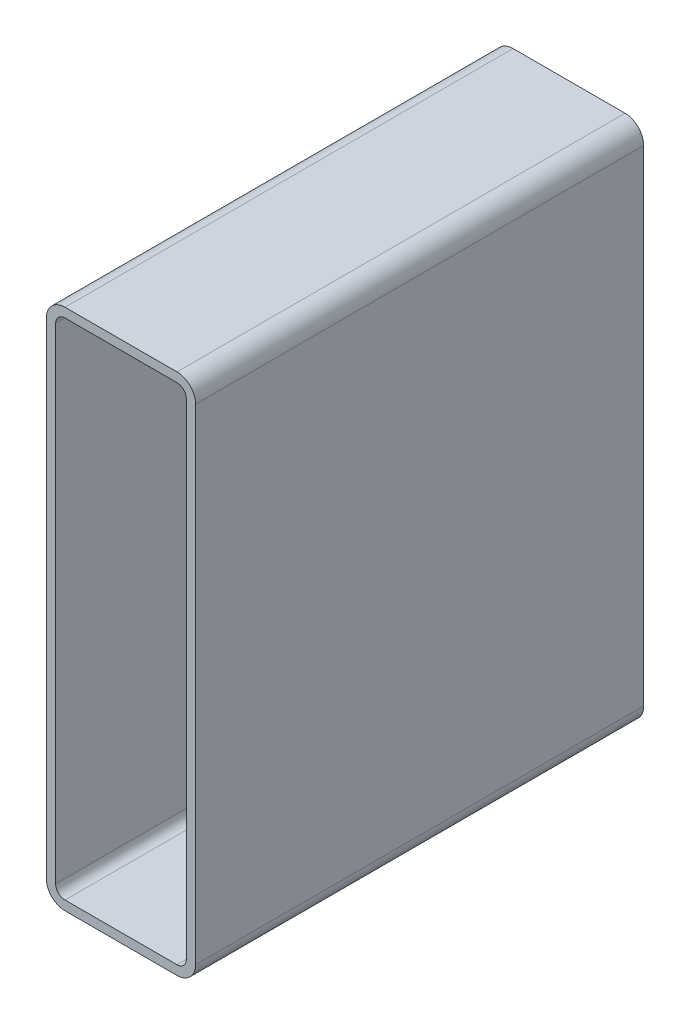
ISO-10303-21;
HEADER;
FILE_DESCRIPTION(('STEP AP214'),'2;1');
FILE_NAME('part.step','',(''),(''),'','','');
FILE_SCHEMA(('AUTOMOTIVE_DESIGN { 1 0 10303 214 1 1 1 1 }'));
ENDSEC;
DATA;
#1=APPLICATION_CONTEXT('core data for automotive mechanical design processes');
#2=APPLICATION_PROTOCOL_DEFINITION('international standard','automotive_design',2000,#1);
#3=PRODUCT_CONTEXT('',#1,'mechanical');
#4=PRODUCT('Part','Part','',(#3));
#5=PRODUCT_RELATED_PRODUCT_CATEGORY('part','',(#4));
#6=PRODUCT_DEFINITION_FORMATION('','',#4);
#7=PRODUCT_DEFINITION_CONTEXT('part definition',#1,'design');
#8=PRODUCT_DEFINITION('design','',#6,#7);
#9=PRODUCT_DEFINITION_SHAPE('','',#8);
#10=(LENGTH_UNIT() NAMED_UNIT(*) SI_UNIT(.MILLI.,.METRE.));
#11=(NAMED_UNIT(*) PLANE_ANGLE_UNIT() SI_UNIT($,.RADIAN.));
#12=(NAMED_UNIT(*) SI_UNIT($,.STERADIAN.) SOLID_ANGLE_UNIT());
#13=UNCERTAINTY_MEASURE_WITH_UNIT(LENGTH_MEASURE(1.E-05),#10,'distance_accuracy_value','');
#14=(GEOMETRIC_REPRESENTATION_CONTEXT(3) GLOBAL_UNCERTAINTY_ASSIGNED_CONTEXT((#13)) GLOBAL_UNIT_ASSIGNED_CONTEXT((#10,
#11,#12)) REPRESENTATION_CONTEXT('',''));
#15=CARTESIAN_POINT('',(0.,0.,0.));
#16=DIRECTION('',(0.,0.,1.));
#17=DIRECTION('',(1.,0.,0.));
#18=AXIS2_PLACEMENT_3D('',#15,#16,#17);
#19=CARTESIAN_POINT('',(14.3751778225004,344.728679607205,304.8));
#20=DIRECTION('',(0.,0.,1.));
#21=DIRECTION('',(1.,0.,0.));
#22=AXIS2_PLACEMENT_3D('',#19,#20,#21);
#23=PLANE('',#22);
#24=CARTESIAN_POINT('',(14.3751778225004,344.728679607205,304.8));
#25=DIRECTION('',(0.,0.,1.));
#26=DIRECTION('',(1.,0.,0.));
#27=AXIS2_PLACEMENT_3D('',#24,#25,#26);
#28=CIRCLE('',#27,12.7);
#29=CARTESIAN_POINT('',(14.3751778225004,357.428679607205,304.8));
#30=VERTEX_POINT('',#29);
#31=CARTESIAN_POINT('',(1.67517782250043,344.728679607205,304.8));
#32=VERTEX_POINT('',#31);
#33=EDGE_CURVE('E211',#30,#32,#28,.T.);
#34=ORIENTED_EDGE('',*,*,#33,.T.);
#35=DIRECTION('',(0.,-1.,0.));
#36=VECTOR('',#35,1.);
#37=CARTESIAN_POINT('',(1.67517782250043,14.5286796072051,304.8));
#38=LINE('',#37,#36);
#39=CARTESIAN_POINT('',(1.67517782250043,14.5286796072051,304.8));
#40=VERTEX_POINT('',#39);
#41=EDGE_CURVE('E214',#32,#40,#38,.T.);
#42=ORIENTED_EDGE('',*,*,#41,.T.);
#43=CARTESIAN_POINT('',(14.3751778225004,14.5286796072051,304.8));
#44=DIRECTION('',(0.,0.,1.));
#45=DIRECTION('',(1.,0.,0.));
#46=AXIS2_PLACEMENT_3D('',#43,#44,#45);
#47=CIRCLE('',#46,12.7);
#48=CARTESIAN_POINT('',(14.3751778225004,1.82867960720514,304.8));
#49=VERTEX_POINT('',#48);
#50=EDGE_CURVE('E217',#40,#49,#47,.T.);
#51=ORIENTED_EDGE('',*,*,#50,.T.);
#52=DIRECTION('',(1.,0.,0.));
#53=VECTOR('',#52,1.);
#54=CARTESIAN_POINT('',(90.5751778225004,1.82867960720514,304.8));
#55=LINE('',#54,#53);
#56=CARTESIAN_POINT('',(90.5751778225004,1.82867960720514,304.8));
#57=VERTEX_POINT('',#56);
#58=EDGE_CURVE('E219',#49,#57,#55,.T.);
#59=ORIENTED_EDGE('',*,*,#58,.T.);
#60=CARTESIAN_POINT('',(90.5751778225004,14.5286796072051,304.8));
#61=DIRECTION('',(0.,0.,1.));
#62=DIRECTION('',(1.,0.,0.));
#63=AXIS2_PLACEMENT_3D('',#60,#61,#62);
#64=CIRCLE('',#63,12.7);
#65=CARTESIAN_POINT('',(103.2751778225,14.5286796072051,304.8));
#66=VERTEX_POINT('',#65);
#67=EDGE_CURVE('E221',#57,#66,#64,.T.);
#68=ORIENTED_EDGE('',*,*,#67,.T.);
#69=DIRECTION('',(0.,1.,0.));
#70=VECTOR('',#69,1.);
#71=CARTESIAN_POINT('',(103.2751778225,344.728679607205,304.8));
#72=LINE('',#71,#70);
#73=CARTESIAN_POINT('',(103.2751778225,344.728679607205,304.8));
#74=VERTEX_POINT('',#73);
#75=EDGE_CURVE('E223',#66,#74,#72,.T.);
#76=ORIENTED_EDGE('',*,*,#75,.T.);
#77=CARTESIAN_POINT('',(90.5751778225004,344.728679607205,304.8));
#78=DIRECTION('',(0.,0.,1.));
#79=DIRECTION('',(1.,0.,0.));
#80=AXIS2_PLACEMENT_3D('',#77,#78,#79);
#81=CIRCLE('',#80,12.7);
#82=CARTESIAN_POINT('',(90.5751778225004,357.428679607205,304.8));
#83=VERTEX_POINT('',#82);
#84=EDGE_CURVE('E225',#74,#83,#81,.T.);
#85=ORIENTED_EDGE('',*,*,#84,.T.);
#86=DIRECTION('',(-1.,0.,0.));
#87=VECTOR('',#86,1.);
#88=CARTESIAN_POINT('',(14.3751778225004,357.428679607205,304.8));
#89=LINE('',#88,#87);
#90=EDGE_CURVE('E227',#83,#30,#89,.T.);
#91=ORIENTED_EDGE('',*,*,#90,.T.);
#92=EDGE_LOOP('',(#34,#42,#51,#59,#68,#76,#85,#91));
#93=FACE_BOUND('',#92,.T.);
#94=DIRECTION('',(0.,-1.,0.));
#95=VECTOR('',#94,1.);
#96=CARTESIAN_POINT('',(8.02517782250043,14.5286796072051,304.8));
#97=LINE('',#96,#95);
#98=CARTESIAN_POINT('',(8.02517782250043,344.728679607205,304.8));
#99=VERTEX_POINT('',#98);
#100=CARTESIAN_POINT('',(8.02517782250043,14.5286796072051,304.8));
#101=VERTEX_POINT('',#100);
#102=EDGE_CURVE('E154',#99,#101,#97,.T.);
#103=ORIENTED_EDGE('',*,*,#102,.F.);
#104=CARTESIAN_POINT('',(14.3751778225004,344.728679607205,304.8));
#105=DIRECTION('',(0.,0.,1.));
#106=DIRECTION('',(1.,0.,0.));
#107=AXIS2_PLACEMENT_3D('',#104,#105,#106);
#108=CIRCLE('',#107,6.35000000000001);
#109=CARTESIAN_POINT('',(14.3751778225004,351.078679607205,304.8));
#110=VERTEX_POINT('',#109);
#111=EDGE_CURVE('E146',#110,#99,#108,.T.);
#112=ORIENTED_EDGE('',*,*,#111,.F.);
#113=DIRECTION('',(-1.,0.,0.));
#114=VECTOR('',#113,1.);
#115=CARTESIAN_POINT('',(14.3751778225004,351.078679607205,304.8));
#116=LINE('',#115,#114);
#117=CARTESIAN_POINT('',(90.5751778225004,351.078679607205,304.8));
#118=VERTEX_POINT('',#117);
#119=EDGE_CURVE('E179',#118,#110,#116,.T.);
#120=ORIENTED_EDGE('',*,*,#119,.F.);
#121=CARTESIAN_POINT('',(90.5751778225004,344.728679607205,304.8));
#122=DIRECTION('',(0.,0.,1.));
#123=DIRECTION('',(1.,0.,0.));
#124=AXIS2_PLACEMENT_3D('',#121,#122,#123);
#125=CIRCLE('',#124,6.35000000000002);
#126=CARTESIAN_POINT('',(96.9251778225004,344.728679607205,304.8));
#127=VERTEX_POINT('',#126);
#128=EDGE_CURVE('E177',#127,#118,#125,.T.);
#129=ORIENTED_EDGE('',*,*,#128,.F.);
#130=DIRECTION('',(0.,1.,0.));
#131=VECTOR('',#130,1.);
#132=CARTESIAN_POINT('',(96.9251778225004,344.728679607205,304.8));
#133=LINE('',#132,#131);
#134=CARTESIAN_POINT('',(96.9251778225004,14.5286796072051,304.8));
#135=VERTEX_POINT('',#134);
#136=EDGE_CURVE('E175',#135,#127,#133,.T.);
#137=ORIENTED_EDGE('',*,*,#136,.F.);
#138=CARTESIAN_POINT('',(90.5751778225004,14.5286796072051,304.8));
#139=DIRECTION('',(0.,0.,1.));
#140=DIRECTION('',(1.,0.,0.));
#141=AXIS2_PLACEMENT_3D('',#138,#139,#140);
#142=CIRCLE('',#141,6.35000000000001);
#143=CARTESIAN_POINT('',(90.5751778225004,8.17867960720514,304.8));
#144=VERTEX_POINT('',#143);
#145=EDGE_CURVE('E173',#144,#135,#142,.T.);
#146=ORIENTED_EDGE('',*,*,#145,.F.);
#147=DIRECTION('',(1.,0.,0.));
#148=VECTOR('',#147,1.);
#149=CARTESIAN_POINT('',(90.5751778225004,8.17867960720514,304.8));
#150=LINE('',#149,#148);
#151=CARTESIAN_POINT('',(14.3751778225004,8.17867960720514,304.8));
#152=VERTEX_POINT('',#151);
#153=EDGE_CURVE('E169',#152,#144,#150,.T.);
#154=ORIENTED_EDGE('',*,*,#153,.F.);
#155=CARTESIAN_POINT('',(14.3751778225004,14.5286796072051,304.8));
#156=DIRECTION('',(0.,0.,1.));
#157=DIRECTION('',(1.,0.,0.));
#158=AXIS2_PLACEMENT_3D('',#155,#156,#157);
#159=CIRCLE('',#158,6.35);
#160=EDGE_CURVE('E167',#101,#152,#159,.T.);
#161=ORIENTED_EDGE('',*,*,#160,.F.);
#162=EDGE_LOOP('',(#103,#112,#120,#129,#137,#146,#154,#161));
#163=FACE_BOUND('',#162,.T.);
#164=ADVANCED_FACE('F33',(#93,#163),#23,.T.);
#165=CARTESIAN_POINT('',(14.3751778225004,344.728679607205,0.));
#166=DIRECTION('',(0.,0.,1.));
#167=DIRECTION('',(1.,0.,0.));
#168=AXIS2_PLACEMENT_3D('',#165,#166,#167);
#169=PLANE('',#168);
#170=CARTESIAN_POINT('',(14.3751778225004,344.728679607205,0.));
#171=DIRECTION('',(0.,0.,1.));
#172=DIRECTION('',(1.,0.,0.));
#173=AXIS2_PLACEMENT_3D('',#170,#171,#172);
#174=CIRCLE('',#173,12.7);
#175=CARTESIAN_POINT('',(14.3751778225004,357.428679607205,0.));
#176=VERTEX_POINT('',#175);
#177=CARTESIAN_POINT('',(1.67517782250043,344.728679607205,0.));
#178=VERTEX_POINT('',#177);
#179=EDGE_CURVE('E162',#176,#178,#174,.T.);
#180=ORIENTED_EDGE('',*,*,#179,.F.);
#181=DIRECTION('',(-1.,0.,0.));
#182=VECTOR('',#181,1.);
#183=CARTESIAN_POINT('',(14.3751778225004,357.428679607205,0.));
#184=LINE('',#183,#182);
#185=CARTESIAN_POINT('',(90.5751778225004,357.428679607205,0.));
#186=VERTEX_POINT('',#185);
#187=EDGE_CURVE('E215',#186,#176,#184,.T.);
#188=ORIENTED_EDGE('',*,*,#187,.F.);
#189=CARTESIAN_POINT('',(90.5751778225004,344.728679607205,0.));
#190=DIRECTION('',(0.,0.,1.));
#191=DIRECTION('',(1.,0.,0.));
#192=AXIS2_PLACEMENT_3D('',#189,#190,#191);
#193=CIRCLE('',#192,12.7);
#194=CARTESIAN_POINT('',(103.2751778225,344.728679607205,0.));
#195=VERTEX_POINT('',#194);
#196=EDGE_CURVE('E242',#195,#186,#193,.T.);
#197=ORIENTED_EDGE('',*,*,#196,.F.);
#198=DIRECTION('',(0.,1.,0.));
#199=VECTOR('',#198,1.);
#200=CARTESIAN_POINT('',(103.2751778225,344.728679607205,0.));
#201=LINE('',#200,#199);
#202=CARTESIAN_POINT('',(103.2751778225,14.5286796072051,0.));
#203=VERTEX_POINT('',#202);
#204=EDGE_CURVE('E240',#203,#195,#201,.T.);
#205=ORIENTED_EDGE('',*,*,#204,.F.);
#206=CARTESIAN_POINT('',(90.5751778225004,14.5286796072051,0.));
#207=DIRECTION('',(0.,0.,1.));
#208=DIRECTION('',(1.,0.,0.));
#209=AXIS2_PLACEMENT_3D('',#206,#207,#208);
#210=CIRCLE('',#209,12.7);
#211=CARTESIAN_POINT('',(90.5751778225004,1.82867960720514,0.));
#212=VERTEX_POINT('',#211);
#213=EDGE_CURVE('E238',#212,#203,#210,.T.);
#214=ORIENTED_EDGE('',*,*,#213,.F.);
#215=DIRECTION('',(1.,0.,0.));
#216=VECTOR('',#215,1.);
#217=CARTESIAN_POINT('',(90.5751778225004,1.82867960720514,0.));
#218=LINE('',#217,#216);
#219=CARTESIAN_POINT('',(14.3751778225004,1.82867960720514,0.));
#220=VERTEX_POINT('',#219);
#221=EDGE_CURVE('E236',#220,#212,#218,.T.);
#222=ORIENTED_EDGE('',*,*,#221,.F.);
#223=CARTESIAN_POINT('',(14.3751778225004,14.5286796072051,0.));
#224=DIRECTION('',(0.,0.,1.));
#225=DIRECTION('',(1.,0.,0.));
#226=AXIS2_PLACEMENT_3D('',#223,#224,#225);
#227=CIRCLE('',#226,12.7);
#228=CARTESIAN_POINT('',(1.67517782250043,14.5286796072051,0.));
#229=VERTEX_POINT('',#228);
#230=EDGE_CURVE('E234',#229,#220,#227,.T.);
#231=ORIENTED_EDGE('',*,*,#230,.F.);
#232=DIRECTION('',(0.,-1.,0.));
#233=VECTOR('',#232,1.);
#234=CARTESIAN_POINT('',(1.67517782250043,14.5286796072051,0.));
#235=LINE('',#234,#233);
#236=EDGE_CURVE('E232',#178,#229,#235,.T.);
#237=ORIENTED_EDGE('',*,*,#236,.F.);
#238=EDGE_LOOP('',(#180,#188,#197,#205,#214,#222,#231,#237));
#239=FACE_BOUND('',#238,.T.);
#240=CARTESIAN_POINT('',(14.3751778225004,344.728679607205,0.));
#241=DIRECTION('',(0.,0.,1.));
#242=DIRECTION('',(1.,0.,0.));
#243=AXIS2_PLACEMENT_3D('',#240,#241,#242);
#244=CIRCLE('',#243,6.35000000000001);
#245=CARTESIAN_POINT('',(14.3751778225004,351.078679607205,0.));
#246=VERTEX_POINT('',#245);
#247=CARTESIAN_POINT('',(8.02517782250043,344.728679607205,0.));
#248=VERTEX_POINT('',#247);
#249=EDGE_CURVE('E56',#246,#248,#244,.T.);
#250=ORIENTED_EDGE('',*,*,#249,.T.);
#251=DIRECTION('',(0.,-1.,0.));
#252=VECTOR('',#251,1.);
#253=CARTESIAN_POINT('',(8.02517782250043,14.5286796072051,0.));
#254=LINE('',#253,#252);
#255=CARTESIAN_POINT('',(8.02517782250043,14.5286796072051,0.));
#256=VERTEX_POINT('',#255);
#257=EDGE_CURVE('E161',#248,#256,#254,.T.);
#258=ORIENTED_EDGE('',*,*,#257,.T.);
#259=CARTESIAN_POINT('',(14.3751778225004,14.5286796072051,0.));
#260=DIRECTION('',(0.,0.,1.));
#261=DIRECTION('',(1.,0.,0.));
#262=AXIS2_PLACEMENT_3D('',#259,#260,#261);
#263=CIRCLE('',#262,6.35);
#264=CARTESIAN_POINT('',(14.3751778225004,8.17867960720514,0.));
#265=VERTEX_POINT('',#264);
#266=EDGE_CURVE('E183',#256,#265,#263,.T.);
#267=ORIENTED_EDGE('',*,*,#266,.T.);
#268=DIRECTION('',(1.,0.,0.));
#269=VECTOR('',#268,1.);
#270=CARTESIAN_POINT('',(90.5751778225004,8.17867960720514,0.));
#271=LINE('',#270,#269);
#272=CARTESIAN_POINT('',(90.5751778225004,8.17867960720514,0.));
#273=VERTEX_POINT('',#272);
#274=EDGE_CURVE('E186',#265,#273,#271,.T.);
#275=ORIENTED_EDGE('',*,*,#274,.T.);
#276=CARTESIAN_POINT('',(90.5751778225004,14.5286796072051,0.));
#277=DIRECTION('',(0.,0.,1.));
#278=DIRECTION('',(1.,0.,0.));
#279=AXIS2_PLACEMENT_3D('',#276,#277,#278);
#280=CIRCLE('',#279,6.35000000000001);
#281=CARTESIAN_POINT('',(96.9251778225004,14.5286796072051,0.));
#282=VERTEX_POINT('',#281);
#283=EDGE_CURVE('E189',#273,#282,#280,.T.);
#284=ORIENTED_EDGE('',*,*,#283,.T.);
#285=DIRECTION('',(0.,1.,0.));
#286=VECTOR('',#285,1.);
#287=CARTESIAN_POINT('',(96.9251778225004,344.728679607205,0.));
#288=LINE('',#287,#286);
#289=CARTESIAN_POINT('',(96.9251778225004,344.728679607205,0.));
#290=VERTEX_POINT('',#289);
#291=EDGE_CURVE('E192',#282,#290,#288,.T.);
#292=ORIENTED_EDGE('',*,*,#291,.T.);
#293=CARTESIAN_POINT('',(90.5751778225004,344.728679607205,0.));
#294=DIRECTION('',(0.,0.,1.));
#295=DIRECTION('',(1.,0.,0.));
#296=AXIS2_PLACEMENT_3D('',#293,#294,#295);
#297=CIRCLE('',#296,6.35000000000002);
#298=CARTESIAN_POINT('',(90.5751778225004,351.078679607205,0.));
#299=VERTEX_POINT('',#298);
#300=EDGE_CURVE('E195',#290,#299,#297,.T.);
#301=ORIENTED_EDGE('',*,*,#300,.T.);
#302=DIRECTION('',(-1.,0.,0.));
#303=VECTOR('',#302,1.);
#304=CARTESIAN_POINT('',(14.3751778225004,351.078679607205,0.));
#305=LINE('',#304,#303);
#306=EDGE_CURVE('E155',#299,#246,#305,.T.);
#307=ORIENTED_EDGE('',*,*,#306,.T.);
#308=EDGE_LOOP('',(#250,#258,#267,#275,#284,#292,#301,#307));
#309=FACE_BOUND('',#308,.T.);
#310=ADVANCED_FACE('F272',(#239,#309),#169,.F.);
#311=CARTESIAN_POINT('',(14.3751778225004,344.728679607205,304.8));
#312=DIRECTION('',(0.,0.,-1.));
#313=DIRECTION('',(-1.,0.,0.));
#314=AXIS2_PLACEMENT_3D('',#311,#312,#313);
#315=CYLINDRICAL_SURFACE('',#314,12.7);
#316=ORIENTED_EDGE('',*,*,#179,.T.);
#317=DIRECTION('',(0.,0.,-1.));
#318=VECTOR('',#317,1.);
#319=CARTESIAN_POINT('',(1.67517782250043,344.728679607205,304.8));
#320=LINE('',#319,#318);
#321=EDGE_CURVE('E11',#32,#178,#320,.T.);
#322=ORIENTED_EDGE('',*,*,#321,.F.);
#323=ORIENTED_EDGE('',*,*,#33,.F.);
#324=DIRECTION('',(0.,0.,-1.));
#325=VECTOR('',#324,1.);
#326=CARTESIAN_POINT('',(14.3751778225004,357.428679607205,304.8));
#327=LINE('',#326,#325);
#328=EDGE_CURVE('E229',#30,#176,#327,.T.);
#329=ORIENTED_EDGE('',*,*,#328,.T.);
#330=EDGE_LOOP('',(#316,#322,#323,#329));
#331=FACE_BOUND('',#330,.T.);
#332=ADVANCED_FACE('F35',(#331),#315,.T.);
#333=CARTESIAN_POINT('',(1.67517782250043,14.5286796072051,304.8));
#334=DIRECTION('',(1.,0.,0.));
#335=DIRECTION('',(0.,0.,-1.));
#336=AXIS2_PLACEMENT_3D('',#333,#334,#335);
#337=PLANE('',#336);
#338=ORIENTED_EDGE('',*,*,#236,.T.);
#339=DIRECTION('',(0.,0.,-1.));
#340=VECTOR('',#339,1.);
#341=CARTESIAN_POINT('',(1.67517782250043,14.5286796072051,304.8));
#342=LINE('',#341,#340);
#343=EDGE_CURVE('E41',#40,#229,#342,.T.);
#344=ORIENTED_EDGE('',*,*,#343,.F.);
#345=ORIENTED_EDGE('',*,*,#41,.F.);
#346=ORIENTED_EDGE('',*,*,#321,.T.);
#347=EDGE_LOOP('',(#338,#344,#345,#346));
#348=FACE_BOUND('',#347,.T.);
#349=ADVANCED_FACE('F289',(#348),#337,.F.);
#350=CARTESIAN_POINT('',(14.3751778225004,14.5286796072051,304.8));
#351=DIRECTION('',(0.,0.,-1.));
#352=DIRECTION('',(-1.,0.,0.));
#353=AXIS2_PLACEMENT_3D('',#350,#351,#352);
#354=CYLINDRICAL_SURFACE('',#353,12.7);
#355=ORIENTED_EDGE('',*,*,#230,.T.);
#356=DIRECTION('',(0.,0.,-1.));
#357=VECTOR('',#356,1.);
#358=CARTESIAN_POINT('',(14.3751778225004,1.82867960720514,304.8));
#359=LINE('',#358,#357);
#360=EDGE_CURVE('E259',#49,#220,#359,.T.);
#361=ORIENTED_EDGE('',*,*,#360,.F.);
#362=ORIENTED_EDGE('',*,*,#50,.F.);
#363=ORIENTED_EDGE('',*,*,#343,.T.);
#364=EDGE_LOOP('',(#355,#361,#362,#363));
#365=FACE_BOUND('',#364,.T.);
#366=ADVANCED_FACE('F266',(#365),#354,.T.);
#367=CARTESIAN_POINT('',(90.5751778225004,1.82867960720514,304.8));
#368=DIRECTION('',(0.,1.,0.));
#369=DIRECTION('',(0.,0.,1.));
#370=AXIS2_PLACEMENT_3D('',#367,#368,#369);
#371=PLANE('',#370);
#372=ORIENTED_EDGE('',*,*,#221,.T.);
#373=DIRECTION('',(0.,0.,-1.));
#374=VECTOR('',#373,1.);
#375=CARTESIAN_POINT('',(90.5751778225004,1.82867960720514,304.8));
#376=LINE('',#375,#374);
#377=EDGE_CURVE('E256',#57,#212,#376,.T.);
#378=ORIENTED_EDGE('',*,*,#377,.F.);
#379=ORIENTED_EDGE('',*,*,#58,.F.);
#380=ORIENTED_EDGE('',*,*,#360,.T.);
#381=EDGE_LOOP('',(#372,#378,#379,#380));
#382=FACE_BOUND('',#381,.T.);
#383=ADVANCED_FACE('F278',(#382),#371,.F.);
#384=CARTESIAN_POINT('',(90.5751778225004,14.5286796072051,304.8));
#385=DIRECTION('',(0.,0.,-1.));
#386=DIRECTION('',(-1.,0.,0.));
#387=AXIS2_PLACEMENT_3D('',#384,#385,#386);
#388=CYLINDRICAL_SURFACE('',#387,12.7);
#389=ORIENTED_EDGE('',*,*,#213,.T.);
#390=DIRECTION('',(0.,0.,-1.));
#391=VECTOR('',#390,1.);
#392=CARTESIAN_POINT('',(103.2751778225,14.5286796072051,304.8));
#393=LINE('',#392,#391);
#394=EDGE_CURVE('E253',#66,#203,#393,.T.);
#395=ORIENTED_EDGE('',*,*,#394,.F.);
#396=ORIENTED_EDGE('',*,*,#67,.F.);
#397=ORIENTED_EDGE('',*,*,#377,.T.);
#398=EDGE_LOOP('',(#389,#395,#396,#397));
#399=FACE_BOUND('',#398,.T.);
#400=ADVANCED_FACE('F282',(#399),#388,.T.);
#401=CARTESIAN_POINT('',(103.2751778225,344.728679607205,304.8));
#402=DIRECTION('',(-1.,0.,0.));
#403=DIRECTION('',(0.,0.,1.));
#404=AXIS2_PLACEMENT_3D('',#401,#402,#403);
#405=PLANE('',#404);
#406=ORIENTED_EDGE('',*,*,#204,.T.);
#407=DIRECTION('',(0.,0.,-1.));
#408=VECTOR('',#407,1.);
#409=CARTESIAN_POINT('',(103.2751778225,344.728679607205,304.8));
#410=LINE('',#409,#408);
#411=EDGE_CURVE('E250',#74,#195,#410,.T.);
#412=ORIENTED_EDGE('',*,*,#411,.F.);
#413=ORIENTED_EDGE('',*,*,#75,.F.);
#414=ORIENTED_EDGE('',*,*,#394,.T.);
#415=EDGE_LOOP('',(#406,#412,#413,#414));
#416=FACE_BOUND('',#415,.T.);
#417=ADVANCED_FACE('F302',(#416),#405,.F.);
#418=CARTESIAN_POINT('',(90.5751778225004,344.728679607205,304.8));
#419=DIRECTION('',(0.,0.,-1.));
#420=DIRECTION('',(-1.,0.,0.));
#421=AXIS2_PLACEMENT_3D('',#418,#419,#420);
#422=CYLINDRICAL_SURFACE('',#421,12.7);
#423=ORIENTED_EDGE('',*,*,#196,.T.);
#424=DIRECTION('',(0.,0.,-1.));
#425=VECTOR('',#424,1.);
#426=CARTESIAN_POINT('',(90.5751778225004,357.428679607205,304.8));
#427=LINE('',#426,#425);
#428=EDGE_CURVE('E247',#83,#186,#427,.T.);
#429=ORIENTED_EDGE('',*,*,#428,.F.);
#430=ORIENTED_EDGE('',*,*,#84,.F.);
#431=ORIENTED_EDGE('',*,*,#411,.T.);
#432=EDGE_LOOP('',(#423,#429,#430,#431));
#433=FACE_BOUND('',#432,.T.);
#434=ADVANCED_FACE('F300',(#433),#422,.T.);
#435=CARTESIAN_POINT('',(14.3751778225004,357.428679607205,304.8));
#436=DIRECTION('',(0.,-1.,0.));
#437=DIRECTION('',(0.,0.,-1.));
#438=AXIS2_PLACEMENT_3D('',#435,#436,#437);
#439=PLANE('',#438);
#440=ORIENTED_EDGE('',*,*,#187,.T.);
#441=ORIENTED_EDGE('',*,*,#328,.F.);
#442=ORIENTED_EDGE('',*,*,#90,.F.);
#443=ORIENTED_EDGE('',*,*,#428,.T.);
#444=EDGE_LOOP('',(#440,#441,#442,#443));
#445=FACE_BOUND('',#444,.T.);
#446=ADVANCED_FACE('F295',(#445),#439,.F.);
#447=CARTESIAN_POINT('',(14.3751778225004,344.728679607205,304.8));
#448=DIRECTION('',(0.,0.,-1.));
#449=DIRECTION('',(-1.,0.,0.));
#450=AXIS2_PLACEMENT_3D('',#447,#448,#449);
#451=CYLINDRICAL_SURFACE('',#450,6.35000000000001);
#452=ORIENTED_EDGE('',*,*,#249,.F.);
#453=DIRECTION('',(0.,0.,-1.));
#454=VECTOR('',#453,1.);
#455=CARTESIAN_POINT('',(14.3751778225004,351.078679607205,304.8));
#456=LINE('',#455,#454);
#457=EDGE_CURVE('E150',#110,#246,#456,.T.);
#458=ORIENTED_EDGE('',*,*,#457,.F.);
#459=ORIENTED_EDGE('',*,*,#111,.T.);
#460=DIRECTION('',(0.,0.,-1.));
#461=VECTOR('',#460,1.);
#462=CARTESIAN_POINT('',(8.02517782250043,344.728679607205,304.8));
#463=LINE('',#462,#461);
#464=EDGE_CURVE('E149',#99,#248,#463,.T.);
#465=ORIENTED_EDGE('',*,*,#464,.T.);
#466=EDGE_LOOP('',(#452,#458,#459,#465));
#467=FACE_BOUND('',#466,.T.);
#468=ADVANCED_FACE('F148',(#467),#451,.F.);
#469=CARTESIAN_POINT('',(8.02517782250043,14.5286796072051,304.8));
#470=DIRECTION('',(1.,0.,0.));
#471=DIRECTION('',(0.,0.,-1.));
#472=AXIS2_PLACEMENT_3D('',#469,#470,#471);
#473=PLANE('',#472);
#474=ORIENTED_EDGE('',*,*,#257,.F.);
#475=ORIENTED_EDGE('',*,*,#464,.F.);
#476=ORIENTED_EDGE('',*,*,#102,.T.);
#477=DIRECTION('',(0.,0.,-1.));
#478=VECTOR('',#477,1.);
#479=CARTESIAN_POINT('',(8.02517782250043,14.5286796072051,304.8));
#480=LINE('',#479,#478);
#481=EDGE_CURVE('E163',#101,#256,#480,.T.);
#482=ORIENTED_EDGE('',*,*,#481,.T.);
#483=EDGE_LOOP('',(#474,#475,#476,#482));
#484=FACE_BOUND('',#483,.T.);
#485=ADVANCED_FACE('F158',(#484),#473,.T.);
#486=CARTESIAN_POINT('',(14.3751778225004,14.5286796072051,304.8));
#487=DIRECTION('',(0.,0.,-1.));
#488=DIRECTION('',(-1.,0.,0.));
#489=AXIS2_PLACEMENT_3D('',#486,#487,#488);
#490=CYLINDRICAL_SURFACE('',#489,6.35);
#491=ORIENTED_EDGE('',*,*,#266,.F.);
#492=ORIENTED_EDGE('',*,*,#481,.F.);
#493=ORIENTED_EDGE('',*,*,#160,.T.);
#494=DIRECTION('',(0.,0.,-1.));
#495=VECTOR('',#494,1.);
#496=CARTESIAN_POINT('',(14.3751778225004,8.17867960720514,304.8));
#497=LINE('',#496,#495);
#498=EDGE_CURVE('E208',#152,#265,#497,.T.);
#499=ORIENTED_EDGE('',*,*,#498,.T.);
#500=EDGE_LOOP('',(#491,#492,#493,#499));
#501=FACE_BOUND('',#500,.T.);
#502=ADVANCED_FACE('F327',(#501),#490,.F.);
#503=CARTESIAN_POINT('',(90.5751778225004,8.17867960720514,304.8));
#504=DIRECTION('',(0.,1.,0.));
#505=DIRECTION('',(0.,0.,1.));
#506=AXIS2_PLACEMENT_3D('',#503,#504,#505);
#507=PLANE('',#506);
#508=ORIENTED_EDGE('',*,*,#274,.F.);
#509=ORIENTED_EDGE('',*,*,#498,.F.);
#510=ORIENTED_EDGE('',*,*,#153,.T.);
#511=DIRECTION('',(0.,0.,-1.));
#512=VECTOR('',#511,1.);
#513=CARTESIAN_POINT('',(90.5751778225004,8.17867960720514,304.8));
#514=LINE('',#513,#512);
#515=EDGE_CURVE('E206',#144,#273,#514,.T.);
#516=ORIENTED_EDGE('',*,*,#515,.T.);
#517=EDGE_LOOP('',(#508,#509,#510,#516));
#518=FACE_BOUND('',#517,.T.);
#519=ADVANCED_FACE('F331',(#518),#507,.T.);
#520=CARTESIAN_POINT('',(90.5751778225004,14.5286796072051,304.8));
#521=DIRECTION('',(0.,0.,-1.));
#522=DIRECTION('',(-1.,0.,0.));
#523=AXIS2_PLACEMENT_3D('',#520,#521,#522);
#524=CYLINDRICAL_SURFACE('',#523,6.35000000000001);
#525=ORIENTED_EDGE('',*,*,#283,.F.);
#526=ORIENTED_EDGE('',*,*,#515,.F.);
#527=ORIENTED_EDGE('',*,*,#145,.T.);
#528=DIRECTION('',(0.,0.,-1.));
#529=VECTOR('',#528,1.);
#530=CARTESIAN_POINT('',(96.9251778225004,14.5286796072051,304.8));
#531=LINE('',#530,#529);
#532=EDGE_CURVE('E204',#135,#282,#531,.T.);
#533=ORIENTED_EDGE('',*,*,#532,.T.);
#534=EDGE_LOOP('',(#525,#526,#527,#533));
#535=FACE_BOUND('',#534,.T.);
#536=ADVANCED_FACE('F337',(#535),#524,.F.);
#537=CARTESIAN_POINT('',(96.9251778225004,344.728679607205,304.8));
#538=DIRECTION('',(-1.,0.,0.));
#539=DIRECTION('',(0.,0.,1.));
#540=AXIS2_PLACEMENT_3D('',#537,#538,#539);
#541=PLANE('',#540);
#542=ORIENTED_EDGE('',*,*,#291,.F.);
#543=ORIENTED_EDGE('',*,*,#532,.F.);
#544=ORIENTED_EDGE('',*,*,#136,.T.);
#545=DIRECTION('',(0.,0.,-1.));
#546=VECTOR('',#545,1.);
#547=CARTESIAN_POINT('',(96.9251778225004,344.728679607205,304.8));
#548=LINE('',#547,#546);
#549=EDGE_CURVE('E202',#127,#290,#548,.T.);
#550=ORIENTED_EDGE('',*,*,#549,.T.);
#551=EDGE_LOOP('',(#542,#543,#544,#550));
#552=FACE_BOUND('',#551,.T.);
#553=ADVANCED_FACE('F341',(#552),#541,.T.);
#554=CARTESIAN_POINT('',(90.5751778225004,344.728679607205,304.8));
#555=DIRECTION('',(0.,0.,-1.));
#556=DIRECTION('',(-1.,0.,0.));
#557=AXIS2_PLACEMENT_3D('',#554,#555,#556);
#558=CYLINDRICAL_SURFACE('',#557,6.35000000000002);
#559=ORIENTED_EDGE('',*,*,#300,.F.);
#560=ORIENTED_EDGE('',*,*,#549,.F.);
#561=ORIENTED_EDGE('',*,*,#128,.T.);
#562=DIRECTION('',(0.,0.,-1.));
#563=VECTOR('',#562,1.);
#564=CARTESIAN_POINT('',(90.5751778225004,351.078679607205,304.8));
#565=LINE('',#564,#563);
#566=EDGE_CURVE('E48',#118,#299,#565,.T.);
#567=ORIENTED_EDGE('',*,*,#566,.T.);
#568=EDGE_LOOP('',(#559,#560,#561,#567));
#569=FACE_BOUND('',#568,.T.);
#570=ADVANCED_FACE('F345',(#569),#558,.F.);
#571=CARTESIAN_POINT('',(14.3751778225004,351.078679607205,304.8));
#572=DIRECTION('',(0.,-1.,0.));
#573=DIRECTION('',(0.,0.,-1.));
#574=AXIS2_PLACEMENT_3D('',#571,#572,#573);
#575=PLANE('',#574);
#576=ORIENTED_EDGE('',*,*,#306,.F.);
#577=ORIENTED_EDGE('',*,*,#566,.F.);
#578=ORIENTED_EDGE('',*,*,#119,.T.);
#579=ORIENTED_EDGE('',*,*,#457,.T.);
#580=EDGE_LOOP('',(#576,#577,#578,#579));
#581=FACE_BOUND('',#580,.T.);
#582=ADVANCED_FACE('F349',(#581),#575,.T.);
#583=CLOSED_SHELL('',(#164,#310,#332,#349,#366,#383,#400,#417,#434,#446,#468,#485,#502,#519,
#536,#553,#570,#582));
#584=MANIFOLD_SOLID_BREP('B2',#583);
#585=ADVANCED_BREP_SHAPE_REPRESENTATION('',(#18,#584),#14);
#586=SHAPE_DEFINITION_REPRESENTATION(#9,#585);
ENDSEC;
END-ISO-10303-21;
